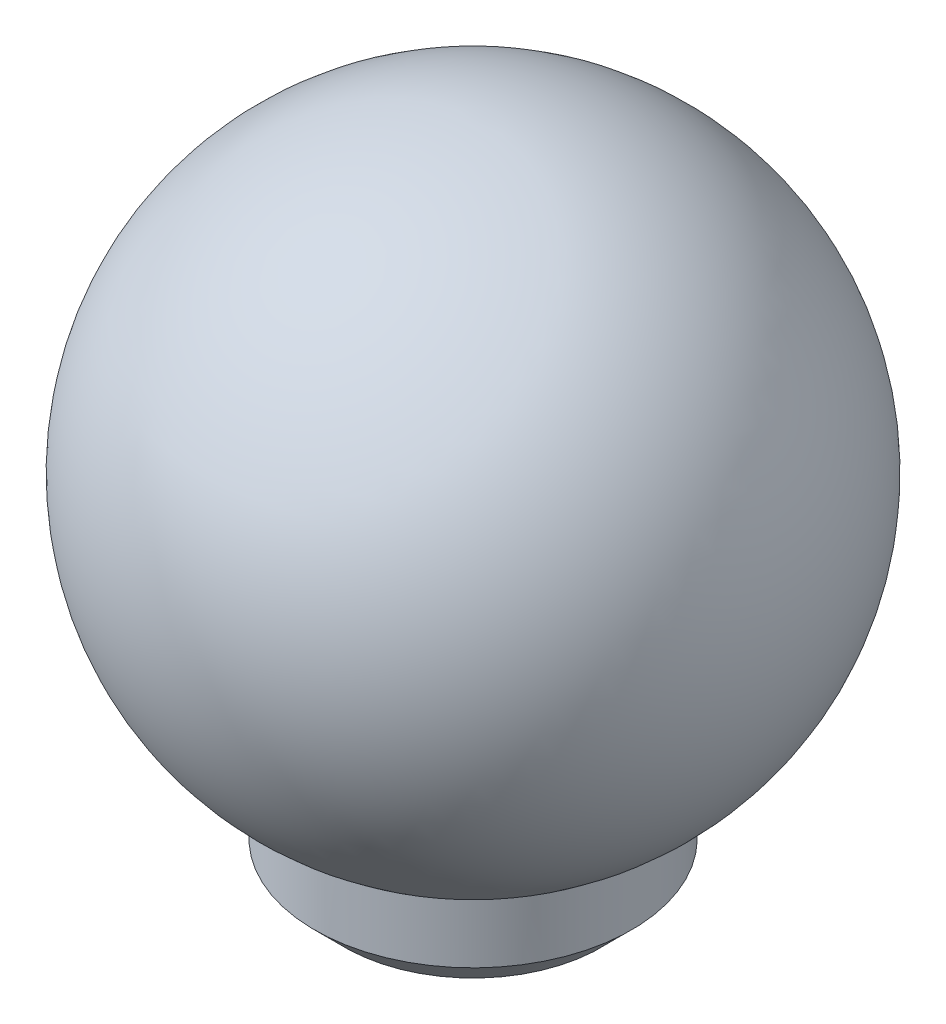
from build123d import *

# Parameters (mm, degrees)
CHAMFER1_SIZE = 1.27


with BuildPart() as part:
    # Sketch2 → Revolve1 (revolve)
    with BuildSketch(Plane.XY):
        with BuildLine():
            Line((6.6675, -10.808998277), (6.6675, -14.591001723))
            Line((6.6675, -14.591001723), (0, -14.591001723))
            Line((0, -14.591001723), (0, 12.7))
            ThreePointArc((0, 12.7), (12.218107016, 3.465236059), (6.6675, -10.808998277))
        make_face()
    revolve(axis=Axis((0, -12.7, 0), (0, -1, 0)))

    # Chamfer1
    chamfer1_edges = [part.edges().sort_by_distance(p)[0] for p in [
        (-6.6675, -14.591001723, 0),
    ]]
    chamfer(chamfer1_edges, length=CHAMFER1_SIZE)


solid = part.part
